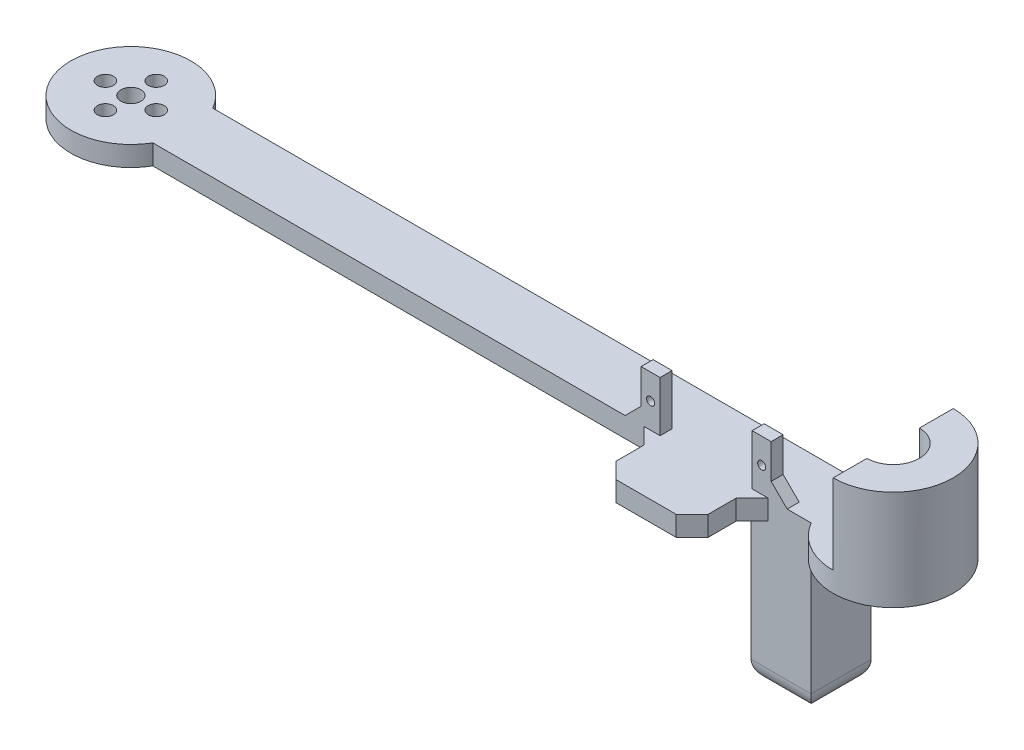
ISO-10303-21;
HEADER;
FILE_DESCRIPTION(('STEP AP214'),'2;1');
FILE_NAME('part.step','',(''),(''),'','','');
FILE_SCHEMA(('AUTOMOTIVE_DESIGN { 1 0 10303 214 1 1 1 1 }'));
ENDSEC;
DATA;
#1=APPLICATION_CONTEXT('core data for automotive mechanical design processes');
#2=APPLICATION_PROTOCOL_DEFINITION('international standard','automotive_design',2000,#1);
#3=PRODUCT_CONTEXT('',#1,'mechanical');
#4=PRODUCT('Part','Part','',(#3));
#5=PRODUCT_RELATED_PRODUCT_CATEGORY('part','',(#4));
#6=PRODUCT_DEFINITION_FORMATION('','',#4);
#7=PRODUCT_DEFINITION_CONTEXT('part definition',#1,'design');
#8=PRODUCT_DEFINITION('design','',#6,#7);
#9=PRODUCT_DEFINITION_SHAPE('','',#8);
#10=(LENGTH_UNIT() NAMED_UNIT(*) SI_UNIT(.MILLI.,.METRE.));
#11=(NAMED_UNIT(*) PLANE_ANGLE_UNIT() SI_UNIT($,.RADIAN.));
#12=(NAMED_UNIT(*) SI_UNIT($,.STERADIAN.) SOLID_ANGLE_UNIT());
#13=UNCERTAINTY_MEASURE_WITH_UNIT(LENGTH_MEASURE(1.E-05),#10,'distance_accuracy_value','');
#14=(GEOMETRIC_REPRESENTATION_CONTEXT(3) GLOBAL_UNCERTAINTY_ASSIGNED_CONTEXT((#13)) GLOBAL_UNIT_ASSIGNED_CONTEXT((#10,
#11,#12)) REPRESENTATION_CONTEXT('',''));
#15=CARTESIAN_POINT('',(0.,0.,0.));
#16=DIRECTION('',(0.,0.,1.));
#17=DIRECTION('',(1.,0.,0.));
#18=AXIS2_PLACEMENT_3D('',#15,#16,#17);
#19=CARTESIAN_POINT('',(0.,0.,0.));
#20=DIRECTION('',(0.,1.,0.));
#21=DIRECTION('',(0.,0.,1.));
#22=AXIS2_PLACEMENT_3D('',#19,#20,#21);
#23=PLANE('',#22);
#24=CARTESIAN_POINT('',(190.5,0.,-7.5));
#25=DIRECTION('',(0.,1.,0.));
#26=DIRECTION('',(0.,0.,1.));
#27=AXIS2_PLACEMENT_3D('',#24,#25,#26);
#28=CIRCLE('',#27,6.55000000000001);
#29=CARTESIAN_POINT('',(190.5,0.,-0.949999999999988));
#30=VERTEX_POINT('',#29);
#31=EDGE_CURVE('E400',#30,#30,#28,.T.);
#32=ORIENTED_EDGE('',*,*,#31,.T.);
#33=EDGE_LOOP('',(#32));
#34=FACE_BOUND('',#33,.T.);
#35=DIRECTION('',(0.,0.,1.));
#36=VECTOR('',#35,1.);
#37=CARTESIAN_POINT('',(177.509618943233,0.,0.));
#38=LINE('',#37,#36);
#39=CARTESIAN_POINT('',(177.509618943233,0.,-15.));
#40=VERTEX_POINT('',#39);
#41=CARTESIAN_POINT('',(177.509618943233,0.,0.));
#42=VERTEX_POINT('',#41);
#43=EDGE_CURVE('E271',#40,#42,#38,.T.);
#44=ORIENTED_EDGE('',*,*,#43,.F.);
#45=CARTESIAN_POINT('',(190.5,0.,-7.5));
#46=DIRECTION('',(0.,1.,0.));
#47=DIRECTION('',(0.,0.,1.));
#48=AXIS2_PLACEMENT_3D('',#45,#46,#47);
#49=CIRCLE('',#48,15.);
#50=EDGE_CURVE('E415',#42,#40,#49,.T.);
#51=ORIENTED_EDGE('',*,*,#50,.F.);
#52=EDGE_LOOP('',(#44,#51));
#53=FACE_BOUND('',#52,.T.);
#54=ADVANCED_FACE('F44',(#34,#53),#23,.F.);
#55=CARTESIAN_POINT('',(0.,0.,-13.85));
#56=DIRECTION('',(0.,1.,0.));
#57=DIRECTION('',(0.,0.,1.));
#58=AXIS2_PLACEMENT_3D('',#55,#56,#57);
#59=CIRCLE('',#58,2.);
#60=CARTESIAN_POINT('',(0.,0.,-11.85));
#61=VERTEX_POINT('',#60);
#62=EDGE_CURVE('E456',#61,#61,#59,.T.);
#63=ORIENTED_EDGE('',*,*,#62,.T.);
#64=EDGE_LOOP('',(#63));
#65=FACE_BOUND('',#64,.T.);
#66=CARTESIAN_POINT('',(6.35,0.,-7.49999999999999));
#67=DIRECTION('',(0.,1.,0.));
#68=DIRECTION('',(0.,0.,1.));
#69=AXIS2_PLACEMENT_3D('',#66,#67,#68);
#70=CIRCLE('',#69,2.);
#71=CARTESIAN_POINT('',(6.35,0.,-5.49999999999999));
#72=VERTEX_POINT('',#71);
#73=EDGE_CURVE('E1099',#72,#72,#70,.T.);
#74=ORIENTED_EDGE('',*,*,#73,.T.);
#75=EDGE_LOOP('',(#74));
#76=FACE_BOUND('',#75,.T.);
#77=CARTESIAN_POINT('',(0.,0.,-1.14999999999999));
#78=DIRECTION('',(0.,1.,0.));
#79=DIRECTION('',(0.,0.,1.));
#80=AXIS2_PLACEMENT_3D('',#77,#78,#79);
#81=CIRCLE('',#80,2.);
#82=CARTESIAN_POINT('',(0.,0.,0.850000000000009));
#83=VERTEX_POINT('',#82);
#84=EDGE_CURVE('E1096',#83,#83,#81,.T.);
#85=ORIENTED_EDGE('',*,*,#84,.T.);
#86=EDGE_LOOP('',(#85));
#87=FACE_BOUND('',#86,.T.);
#88=CARTESIAN_POINT('',(-6.35,0.,-7.49999999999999));
#89=DIRECTION('',(0.,1.,0.));
#90=DIRECTION('',(0.,0.,1.));
#91=AXIS2_PLACEMENT_3D('',#88,#89,#90);
#92=CIRCLE('',#91,2.);
#93=CARTESIAN_POINT('',(-6.35,0.,-5.49999999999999));
#94=VERTEX_POINT('',#93);
#95=EDGE_CURVE('E1093',#94,#94,#92,.T.);
#96=ORIENTED_EDGE('',*,*,#95,.T.);
#97=EDGE_LOOP('',(#96));
#98=FACE_BOUND('',#97,.T.);
#99=CARTESIAN_POINT('',(0.,0.,-7.49999999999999));
#100=DIRECTION('',(0.,1.,0.));
#101=DIRECTION('',(0.,0.,1.));
#102=AXIS2_PLACEMENT_3D('',#99,#100,#101);
#103=CIRCLE('',#102,2.5);
#104=CARTESIAN_POINT('',(0.,0.,-4.99999999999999));
#105=VERTEX_POINT('',#104);
#106=EDGE_CURVE('E393',#105,#105,#103,.T.);
#107=ORIENTED_EDGE('',*,*,#106,.T.);
#108=EDGE_LOOP('',(#107));
#109=FACE_BOUND('',#108,.T.);
#110=DIRECTION('',(1.,0.,0.));
#111=VECTOR('',#110,1.);
#112=CARTESIAN_POINT('',(139.759618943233,0.,15.));
#113=LINE('',#112,#111);
#114=CARTESIAN_POINT('',(143.759618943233,0.,15.));
#115=VERTEX_POINT('',#114);
#116=CARTESIAN_POINT('',(158.759618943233,0.,15.));
#117=VERTEX_POINT('',#116);
#118=EDGE_CURVE('E316',#115,#117,#113,.T.);
#119=ORIENTED_EDGE('',*,*,#118,.F.);
#120=DIRECTION('',(-0.707106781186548,0.,-0.707106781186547));
#121=VECTOR('',#120,1.);
#122=CARTESIAN_POINT('',(143.759618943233,0.,15.));
#123=LINE('',#122,#121);
#124=CARTESIAN_POINT('',(139.759618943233,0.,11.));
#125=VERTEX_POINT('',#124);
#126=EDGE_CURVE('E471',#115,#125,#123,.T.);
#127=ORIENTED_EDGE('',*,*,#126,.T.);
#128=DIRECTION('',(0.,0.,-1.));
#129=VECTOR('',#128,1.);
#130=CARTESIAN_POINT('',(139.759618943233,0.,15.));
#131=LINE('',#130,#129);
#132=CARTESIAN_POINT('',(139.759618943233,0.,4.));
#133=VERTEX_POINT('',#132);
#134=EDGE_CURVE('E331',#125,#133,#131,.T.);
#135=ORIENTED_EDGE('',*,*,#134,.T.);
#136=DIRECTION('',(0.707106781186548,0.,0.707106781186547));
#137=VECTOR('',#136,1.);
#138=CARTESIAN_POINT('',(67.8798094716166,0.,-67.8798094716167));
#139=LINE('',#138,#137);
#140=CARTESIAN_POINT('',(135.759618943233,0.,0.));
#141=VERTEX_POINT('',#140);
#142=EDGE_CURVE('E508',#133,#141,#139,.F.);
#143=ORIENTED_EDGE('',*,*,#142,.T.);
#144=DIRECTION('',(1.,0.,0.));
#145=VECTOR('',#144,1.);
#146=CARTESIAN_POINT('',(0.,0.,0.));
#147=LINE('',#146,#145);
#148=CARTESIAN_POINT('',(12.9903810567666,0.,0.));
#149=VERTEX_POINT('',#148);
#150=EDGE_CURVE('E429',#149,#141,#147,.T.);
#151=ORIENTED_EDGE('',*,*,#150,.F.);
#152=CARTESIAN_POINT('',(0.,0.,-7.49999999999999));
#153=DIRECTION('',(0.,1.,0.));
#154=DIRECTION('',(0.,0.,1.));
#155=AXIS2_PLACEMENT_3D('',#152,#153,#154);
#156=CIRCLE('',#155,15.);
#157=CARTESIAN_POINT('',(12.9903810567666,0.,-15.));
#158=VERTEX_POINT('',#157);
#159=EDGE_CURVE('E405',#158,#149,#156,.T.);
#160=ORIENTED_EDGE('',*,*,#159,.F.);
#161=DIRECTION('',(-1.,0.,0.));
#162=VECTOR('',#161,1.);
#163=CARTESIAN_POINT('',(190.5,0.,-15.));
#164=LINE('',#163,#162);
#165=CARTESIAN_POINT('',(162.509618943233,0.,-15.));
#166=VERTEX_POINT('',#165);
#167=EDGE_CURVE('E269',#166,#158,#164,.T.);
#168=ORIENTED_EDGE('',*,*,#167,.F.);
#169=DIRECTION('',(0.,0.,-1.));
#170=VECTOR('',#169,1.);
#171=CARTESIAN_POINT('',(162.509618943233,0.,0.));
#172=LINE('',#171,#170);
#173=CARTESIAN_POINT('',(162.509618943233,0.,0.));
#174=VERTEX_POINT('',#173);
#175=EDGE_CURVE('E253',#174,#166,#172,.T.);
#176=ORIENTED_EDGE('',*,*,#175,.F.);
#177=DIRECTION('',(-1.,0.,0.));
#178=VECTOR('',#177,1.);
#179=CARTESIAN_POINT('',(177.509618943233,0.,0.));
#180=LINE('',#179,#178);
#181=CARTESIAN_POINT('',(166.759618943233,0.,0.));
#182=VERTEX_POINT('',#181);
#183=EDGE_CURVE('E266',#182,#174,#180,.T.);
#184=ORIENTED_EDGE('',*,*,#183,.F.);
#185=DIRECTION('',(0.707106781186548,0.,-0.707106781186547));
#186=VECTOR('',#185,1.);
#187=CARTESIAN_POINT('',(83.3798094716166,0.,83.3798094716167));
#188=LINE('',#187,#186);
#189=CARTESIAN_POINT('',(162.759618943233,0.,4.));
#190=VERTEX_POINT('',#189);
#191=EDGE_CURVE('E506',#182,#190,#188,.F.);
#192=ORIENTED_EDGE('',*,*,#191,.T.);
#193=DIRECTION('',(0.,0.,-1.));
#194=VECTOR('',#193,1.);
#195=CARTESIAN_POINT('',(162.759618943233,0.,15.));
#196=LINE('',#195,#194);
#197=CARTESIAN_POINT('',(162.759618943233,0.,11.));
#198=VERTEX_POINT('',#197);
#199=EDGE_CURVE('E328',#198,#190,#196,.T.);
#200=ORIENTED_EDGE('',*,*,#199,.F.);
#201=DIRECTION('',(-0.707106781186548,0.,0.707106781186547));
#202=VECTOR('',#201,1.);
#203=CARTESIAN_POINT('',(158.759618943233,0.,15.));
#204=LINE('',#203,#202);
#205=EDGE_CURVE('E469',#198,#117,#204,.T.);
#206=ORIENTED_EDGE('',*,*,#205,.T.);
#207=EDGE_LOOP('',(#119,#127,#135,#143,#151,#160,#168,#176,#184,#192,#200,#206));
#208=FACE_BOUND('',#207,.T.);
#209=ADVANCED_FACE('F265',(#65,#76,#87,#98,#109,#208),#23,.F.);
#210=CARTESIAN_POINT('',(0.,5.,0.));
#211=DIRECTION('',(0.,0.,-1.));
#212=DIRECTION('',(-1.,0.,0.));
#213=AXIS2_PLACEMENT_3D('',#210,#211,#212);
#214=PLANE('',#213);
#215=CARTESIAN_POINT('',(137.384618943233,11.3,0.));
#216=DIRECTION('',(0.,0.,1.));
#217=DIRECTION('',(1.,0.,0.));
#218=AXIS2_PLACEMENT_3D('',#215,#216,#217);
#219=CIRCLE('',#218,0.999999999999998);
#220=CARTESIAN_POINT('',(138.384618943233,11.3,0.));
#221=VERTEX_POINT('',#220);
#222=EDGE_CURVE('E335',#221,#221,#219,.T.);
#223=ORIENTED_EDGE('',*,*,#222,.F.);
#224=EDGE_LOOP('',(#223));
#225=FACE_BOUND('',#224,.T.);
#226=ORIENTED_EDGE('',*,*,#150,.T.);
#227=DIRECTION('',(0.,1.,0.));
#228=VECTOR('',#227,1.);
#229=CARTESIAN_POINT('',(135.759618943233,5.,0.));
#230=LINE('',#229,#228);
#231=CARTESIAN_POINT('',(135.759618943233,5.,0.));
#232=VERTEX_POINT('',#231);
#233=EDGE_CURVE('E497',#141,#232,#230,.T.);
#234=ORIENTED_EDGE('',*,*,#233,.T.);
#235=DIRECTION('',(1.,0.,0.));
#236=VECTOR('',#235,1.);
#237=CARTESIAN_POINT('',(0.,5.,0.));
#238=LINE('',#237,#236);
#239=CARTESIAN_POINT('',(139.759618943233,5.,0.));
#240=VERTEX_POINT('',#239);
#241=EDGE_CURVE('E495',#232,#240,#238,.T.);
#242=ORIENTED_EDGE('',*,*,#241,.T.);
#243=DIRECTION('',(0.,-1.,0.));
#244=VECTOR('',#243,1.);
#245=CARTESIAN_POINT('',(139.759618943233,17.6,0.));
#246=LINE('',#245,#244);
#247=CARTESIAN_POINT('',(139.759618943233,17.6,0.));
#248=VERTEX_POINT('',#247);
#249=EDGE_CURVE('E377',#248,#240,#246,.T.);
#250=ORIENTED_EDGE('',*,*,#249,.F.);
#251=DIRECTION('',(1.,0.,0.));
#252=VECTOR('',#251,1.);
#253=CARTESIAN_POINT('',(0.,17.6,0.));
#254=LINE('',#253,#252);
#255=CARTESIAN_POINT('',(135.009618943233,17.6,0.));
#256=VERTEX_POINT('',#255);
#257=EDGE_CURVE('E375',#256,#248,#254,.T.);
#258=ORIENTED_EDGE('',*,*,#257,.F.);
#259=DIRECTION('',(0.,-1.,0.));
#260=VECTOR('',#259,1.);
#261=CARTESIAN_POINT('',(135.009618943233,17.6,0.));
#262=LINE('',#261,#260);
#263=CARTESIAN_POINT('',(135.009618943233,9.,0.));
#264=VERTEX_POINT('',#263);
#265=EDGE_CURVE('E383',#256,#264,#262,.T.);
#266=ORIENTED_EDGE('',*,*,#265,.T.);
#267=DIRECTION('',(-0.707106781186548,-0.707106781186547,0.));
#268=VECTOR('',#267,1.);
#269=CARTESIAN_POINT('',(65.5048094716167,-60.5048094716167,0.));
#270=LINE('',#269,#268);
#271=CARTESIAN_POINT('',(131.009618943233,5.,0.));
#272=VERTEX_POINT('',#271);
#273=EDGE_CURVE('E512',#264,#272,#270,.T.);
#274=ORIENTED_EDGE('',*,*,#273,.T.);
#275=DIRECTION('',(1.,0.,0.));
#276=VECTOR('',#275,1.);
#277=CARTESIAN_POINT('',(0.,5.,0.));
#278=LINE('',#277,#276);
#279=CARTESIAN_POINT('',(12.9903810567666,5.,0.));
#280=VERTEX_POINT('',#279);
#281=EDGE_CURVE('E278',#280,#272,#278,.T.);
#282=ORIENTED_EDGE('',*,*,#281,.F.);
#283=DIRECTION('',(0.,1.,0.));
#284=VECTOR('',#283,1.);
#285=CARTESIAN_POINT('',(12.9903810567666,0.,0.));
#286=LINE('',#285,#284);
#287=EDGE_CURVE('E407',#280,#149,#286,.F.);
#288=ORIENTED_EDGE('',*,*,#287,.T.);
#289=EDGE_LOOP('',(#226,#234,#242,#250,#258,#266,#274,#282,#288));
#290=FACE_BOUND('',#289,.T.);
#291=ADVANCED_FACE('F603',(#225,#290),#214,.F.);
#292=CARTESIAN_POINT('',(165.134618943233,11.3,0.));
#293=DIRECTION('',(0.,0.,1.));
#294=DIRECTION('',(1.,0.,0.));
#295=AXIS2_PLACEMENT_3D('',#292,#293,#294);
#296=CIRCLE('',#295,0.999999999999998);
#297=CARTESIAN_POINT('',(166.134618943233,11.3,0.));
#298=VERTEX_POINT('',#297);
#299=EDGE_CURVE('E334',#298,#298,#296,.T.);
#300=ORIENTED_EDGE('',*,*,#299,.F.);
#301=EDGE_LOOP('',(#300));
#302=FACE_BOUND('',#301,.T.);
#303=DIRECTION('',(0.,-1.,0.));
#304=VECTOR('',#303,1.);
#305=CARTESIAN_POINT('',(162.759618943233,17.6,0.));
#306=LINE('',#305,#304);
#307=CARTESIAN_POINT('',(162.759618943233,17.6,0.));
#308=VERTEX_POINT('',#307);
#309=CARTESIAN_POINT('',(162.759618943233,5.,0.));
#310=VERTEX_POINT('',#309);
#311=EDGE_CURVE('E359',#308,#310,#306,.T.);
#312=ORIENTED_EDGE('',*,*,#311,.T.);
#313=DIRECTION('',(1.,0.,0.));
#314=VECTOR('',#313,1.);
#315=CARTESIAN_POINT('',(0.,5.,0.));
#316=LINE('',#315,#314);
#317=CARTESIAN_POINT('',(166.759618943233,5.,0.));
#318=VERTEX_POINT('',#317);
#319=EDGE_CURVE('E60',#310,#318,#316,.T.);
#320=ORIENTED_EDGE('',*,*,#319,.T.);
#321=DIRECTION('',(0.,-1.,0.));
#322=VECTOR('',#321,1.);
#323=CARTESIAN_POINT('',(166.759618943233,0.,0.));
#324=LINE('',#323,#322);
#325=EDGE_CURVE('E275',#318,#182,#324,.T.);
#326=ORIENTED_EDGE('',*,*,#325,.T.);
#327=ORIENTED_EDGE('',*,*,#183,.T.);
#328=DIRECTION('',(0.,1.,0.));
#329=VECTOR('',#328,1.);
#330=CARTESIAN_POINT('',(162.509618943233,-37.,0.));
#331=LINE('',#330,#329);
#332=CARTESIAN_POINT('',(162.509618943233,-32.,0.));
#333=VERTEX_POINT('',#332);
#334=EDGE_CURVE('E249',#333,#174,#331,.T.);
#335=ORIENTED_EDGE('',*,*,#334,.F.);
#336=DIRECTION('',(-1.,0.,0.));
#337=VECTOR('',#336,1.);
#338=CARTESIAN_POINT('',(0.,-32.,0.));
#339=LINE('',#338,#337);
#340=CARTESIAN_POINT('',(177.509618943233,-32.,0.));
#341=VERTEX_POINT('',#340);
#342=EDGE_CURVE('E448',#333,#341,#339,.F.);
#343=ORIENTED_EDGE('',*,*,#342,.T.);
#344=DIRECTION('',(0.,1.,0.));
#345=VECTOR('',#344,1.);
#346=CARTESIAN_POINT('',(177.509618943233,-37.,0.));
#347=LINE('',#346,#345);
#348=EDGE_CURVE('E259',#341,#42,#347,.T.);
#349=ORIENTED_EDGE('',*,*,#348,.T.);
#350=DIRECTION('',(0.,1.,0.));
#351=VECTOR('',#350,1.);
#352=CARTESIAN_POINT('',(177.509618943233,0.,0.));
#353=LINE('',#352,#351);
#354=CARTESIAN_POINT('',(177.509618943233,5.,0.));
#355=VERTEX_POINT('',#354);
#356=EDGE_CURVE('E418',#42,#355,#353,.T.);
#357=ORIENTED_EDGE('',*,*,#356,.T.);
#358=CARTESIAN_POINT('',(171.509618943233,5.,0.));
#359=VERTEX_POINT('',#358);
#360=EDGE_CURVE('E283',#359,#355,#278,.T.);
#361=ORIENTED_EDGE('',*,*,#360,.F.);
#362=DIRECTION('',(0.707106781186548,-0.707106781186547,0.));
#363=VECTOR('',#362,1.);
#364=CARTESIAN_POINT('',(85.7548094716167,90.7548094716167,0.));
#365=LINE('',#364,#363);
#366=CARTESIAN_POINT('',(167.509618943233,9.,0.));
#367=VERTEX_POINT('',#366);
#368=EDGE_CURVE('E53',#359,#367,#365,.F.);
#369=ORIENTED_EDGE('',*,*,#368,.T.);
#370=DIRECTION('',(0.,-1.,0.));
#371=VECTOR('',#370,1.);
#372=CARTESIAN_POINT('',(167.509618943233,17.6,0.));
#373=LINE('',#372,#371);
#374=CARTESIAN_POINT('',(167.509618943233,17.6,0.));
#375=VERTEX_POINT('',#374);
#376=EDGE_CURVE('E352',#375,#367,#373,.T.);
#377=ORIENTED_EDGE('',*,*,#376,.F.);
#378=DIRECTION('',(1.,0.,0.));
#379=VECTOR('',#378,1.);
#380=CARTESIAN_POINT('',(0.,17.6,0.));
#381=LINE('',#380,#379);
#382=EDGE_CURVE('E350',#308,#375,#381,.T.);
#383=ORIENTED_EDGE('',*,*,#382,.F.);
#384=EDGE_LOOP('',(#312,#320,#326,#327,#335,#343,#349,#357,#361,#369,#377,#383));
#385=FACE_BOUND('',#384,.T.);
#386=ADVANCED_FACE('F273',(#302,#385),#214,.F.);
#387=CARTESIAN_POINT('',(190.5,5.,-15.));
#388=DIRECTION('',(0.,0.,1.));
#389=DIRECTION('',(1.,0.,0.));
#390=AXIS2_PLACEMENT_3D('',#387,#388,#389);
#391=PLANE('',#390);
#392=DIRECTION('',(0.,1.,0.));
#393=VECTOR('',#392,1.);
#394=CARTESIAN_POINT('',(177.509618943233,-37.,-15.));
#395=LINE('',#394,#393);
#396=CARTESIAN_POINT('',(177.509618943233,-32.,-15.));
#397=VERTEX_POINT('',#396);
#398=EDGE_CURVE('E270',#397,#40,#395,.T.);
#399=ORIENTED_EDGE('',*,*,#398,.F.);
#400=DIRECTION('',(1.,0.,0.));
#401=VECTOR('',#400,1.);
#402=CARTESIAN_POINT('',(190.5,-32.,-15.));
#403=LINE('',#402,#401);
#404=CARTESIAN_POINT('',(162.509618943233,-32.,-15.));
#405=VERTEX_POINT('',#404);
#406=EDGE_CURVE('E444',#397,#405,#403,.F.);
#407=ORIENTED_EDGE('',*,*,#406,.T.);
#408=DIRECTION('',(0.,1.,0.));
#409=VECTOR('',#408,1.);
#410=CARTESIAN_POINT('',(162.509618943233,-37.,-15.));
#411=LINE('',#410,#409);
#412=EDGE_CURVE('E260',#405,#166,#411,.T.);
#413=ORIENTED_EDGE('',*,*,#412,.T.);
#414=ORIENTED_EDGE('',*,*,#167,.T.);
#415=DIRECTION('',(0.,1.,0.));
#416=VECTOR('',#415,1.);
#417=CARTESIAN_POINT('',(12.9903810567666,0.,-15.));
#418=LINE('',#417,#416);
#419=CARTESIAN_POINT('',(12.9903810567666,5.,-15.));
#420=VERTEX_POINT('',#419);
#421=EDGE_CURVE('E411',#158,#420,#418,.T.);
#422=ORIENTED_EDGE('',*,*,#421,.T.);
#423=DIRECTION('',(-1.,0.,0.));
#424=VECTOR('',#423,1.);
#425=CARTESIAN_POINT('',(190.5,5.,-15.));
#426=LINE('',#425,#424);
#427=CARTESIAN_POINT('',(177.509618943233,5.,-15.));
#428=VERTEX_POINT('',#427);
#429=EDGE_CURVE('E427',#428,#420,#426,.T.);
#430=ORIENTED_EDGE('',*,*,#429,.F.);
#431=DIRECTION('',(0.,1.,0.));
#432=VECTOR('',#431,1.);
#433=CARTESIAN_POINT('',(177.509618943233,0.,-15.));
#434=LINE('',#433,#432);
#435=EDGE_CURVE('E424',#428,#40,#434,.F.);
#436=ORIENTED_EDGE('',*,*,#435,.T.);
#437=EDGE_LOOP('',(#399,#407,#413,#414,#422,#430,#436));
#438=FACE_BOUND('',#437,.T.);
#439=ADVANCED_FACE('F566',(#438),#391,.F.);
#440=CARTESIAN_POINT('',(0.,5.,0.));
#441=DIRECTION('',(0.,1.,0.));
#442=DIRECTION('',(0.,0.,1.));
#443=AXIS2_PLACEMENT_3D('',#440,#441,#442);
#444=PLANE('',#443);
#445=CARTESIAN_POINT('',(0.,5.,-13.85));
#446=DIRECTION('',(0.,1.,0.));
#447=DIRECTION('',(0.,0.,1.));
#448=AXIS2_PLACEMENT_3D('',#445,#446,#447);
#449=CIRCLE('',#448,2.);
#450=CARTESIAN_POINT('',(0.,5.,-11.85));
#451=VERTEX_POINT('',#450);
#452=EDGE_CURVE('E1077',#451,#451,#449,.T.);
#453=ORIENTED_EDGE('',*,*,#452,.F.);
#454=EDGE_LOOP('',(#453));
#455=FACE_BOUND('',#454,.T.);
#456=CARTESIAN_POINT('',(6.35,5.,-7.49999999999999));
#457=DIRECTION('',(0.,1.,0.));
#458=DIRECTION('',(0.,0.,1.));
#459=AXIS2_PLACEMENT_3D('',#456,#457,#458);
#460=CIRCLE('',#459,2.);
#461=CARTESIAN_POINT('',(6.35,5.,-5.49999999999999));
#462=VERTEX_POINT('',#461);
#463=EDGE_CURVE('E1081',#462,#462,#460,.T.);
#464=ORIENTED_EDGE('',*,*,#463,.F.);
#465=EDGE_LOOP('',(#464));
#466=FACE_BOUND('',#465,.T.);
#467=CARTESIAN_POINT('',(0.,5.,-1.14999999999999));
#468=DIRECTION('',(0.,1.,0.));
#469=DIRECTION('',(0.,0.,1.));
#470=AXIS2_PLACEMENT_3D('',#467,#468,#469);
#471=CIRCLE('',#470,2.);
#472=CARTESIAN_POINT('',(0.,5.,0.850000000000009));
#473=VERTEX_POINT('',#472);
#474=EDGE_CURVE('E1085',#473,#473,#471,.T.);
#475=ORIENTED_EDGE('',*,*,#474,.F.);
#476=EDGE_LOOP('',(#475));
#477=FACE_BOUND('',#476,.T.);
#478=CARTESIAN_POINT('',(-6.35,5.,-7.49999999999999));
#479=DIRECTION('',(0.,1.,0.));
#480=DIRECTION('',(0.,0.,1.));
#481=AXIS2_PLACEMENT_3D('',#478,#479,#480);
#482=CIRCLE('',#481,2.);
#483=CARTESIAN_POINT('',(-6.35,5.,-5.49999999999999));
#484=VERTEX_POINT('',#483);
#485=EDGE_CURVE('E1088',#484,#484,#482,.T.);
#486=ORIENTED_EDGE('',*,*,#485,.F.);
#487=EDGE_LOOP('',(#486));
#488=FACE_BOUND('',#487,.T.);
#489=DIRECTION('',(0.,0.,-1.));
#490=VECTOR('',#489,1.);
#491=CARTESIAN_POINT('',(139.759618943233,5.,15.));
#492=LINE('',#491,#490);
#493=CARTESIAN_POINT('',(139.759618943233,5.,11.));
#494=VERTEX_POINT('',#493);
#495=CARTESIAN_POINT('',(139.759618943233,5.,4.));
#496=VERTEX_POINT('',#495);
#497=EDGE_CURVE('E322',#494,#496,#492,.T.);
#498=ORIENTED_EDGE('',*,*,#497,.F.);
#499=DIRECTION('',(0.707106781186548,0.,0.707106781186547));
#500=VECTOR('',#499,1.);
#501=CARTESIAN_POINT('',(64.3798094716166,5.,-64.3798094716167));
#502=LINE('',#501,#500);
#503=CARTESIAN_POINT('',(143.759618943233,5.,15.));
#504=VERTEX_POINT('',#503);
#505=EDGE_CURVE('E486',#494,#504,#502,.T.);
#506=ORIENTED_EDGE('',*,*,#505,.T.);
#507=DIRECTION('',(-1.,0.,0.));
#508=VECTOR('',#507,1.);
#509=CARTESIAN_POINT('',(139.759618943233,5.,15.));
#510=LINE('',#509,#508);
#511=CARTESIAN_POINT('',(158.759618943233,5.,15.));
#512=VERTEX_POINT('',#511);
#513=EDGE_CURVE('E319',#512,#504,#510,.T.);
#514=ORIENTED_EDGE('',*,*,#513,.F.);
#515=DIRECTION('',(0.707106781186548,0.,-0.707106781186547));
#516=VECTOR('',#515,1.);
#517=CARTESIAN_POINT('',(86.8798094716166,5.,86.8798094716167));
#518=LINE('',#517,#516);
#519=CARTESIAN_POINT('',(162.759618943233,5.,11.));
#520=VERTEX_POINT('',#519);
#521=EDGE_CURVE('E484',#512,#520,#518,.T.);
#522=ORIENTED_EDGE('',*,*,#521,.T.);
#523=DIRECTION('',(0.,0.,-1.));
#524=VECTOR('',#523,1.);
#525=CARTESIAN_POINT('',(162.759618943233,5.,15.));
#526=LINE('',#525,#524);
#527=CARTESIAN_POINT('',(162.759618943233,5.,4.));
#528=VERTEX_POINT('',#527);
#529=EDGE_CURVE('E325',#520,#528,#526,.T.);
#530=ORIENTED_EDGE('',*,*,#529,.T.);
#531=DIRECTION('',(-0.707106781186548,0.,0.707106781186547));
#532=VECTOR('',#531,1.);
#533=CARTESIAN_POINT('',(162.759618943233,5.,4.));
#534=LINE('',#533,#532);
#535=EDGE_CURVE('E504',#528,#318,#534,.F.);
#536=ORIENTED_EDGE('',*,*,#535,.T.);
#537=ORIENTED_EDGE('',*,*,#319,.F.);
#538=DIRECTION('',(0.,0.,-1.));
#539=VECTOR('',#538,1.);
#540=CARTESIAN_POINT('',(162.759618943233,5.,0.));
#541=LINE('',#540,#539);
#542=CARTESIAN_POINT('',(162.759618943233,5.,-3.));
#543=VERTEX_POINT('',#542);
#544=EDGE_CURVE('E345',#310,#543,#541,.T.);
#545=ORIENTED_EDGE('',*,*,#544,.T.);
#546=DIRECTION('',(-1.,0.,0.));
#547=VECTOR('',#546,1.);
#548=CARTESIAN_POINT('',(0.,5.,-3.00000000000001));
#549=LINE('',#548,#547);
#550=CARTESIAN_POINT('',(171.509618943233,5.,-3.));
#551=VERTEX_POINT('',#550);
#552=EDGE_CURVE('E353',#551,#543,#549,.T.);
#553=ORIENTED_EDGE('',*,*,#552,.F.);
#554=DIRECTION('',(0.,0.,1.));
#555=VECTOR('',#554,1.);
#556=CARTESIAN_POINT('',(171.509618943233,5.,0.));
#557=LINE('',#556,#555);
#558=EDGE_CURVE('E478',#551,#359,#557,.T.);
#559=ORIENTED_EDGE('',*,*,#558,.T.);
#560=ORIENTED_EDGE('',*,*,#360,.T.);
#561=CARTESIAN_POINT('',(190.5,5.,-7.5));
#562=DIRECTION('',(0.,1.,0.));
#563=DIRECTION('',(0.,0.,1.));
#564=AXIS2_PLACEMENT_3D('',#561,#562,#563);
#565=CIRCLE('',#564,15.);
#566=CARTESIAN_POINT('',(190.5,5.,7.50000000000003));
#567=VERTEX_POINT('',#566);
#568=EDGE_CURVE('E419',#355,#567,#565,.T.);
#569=ORIENTED_EDGE('',*,*,#568,.T.);
#570=DIRECTION('',(0.,0.,-1.));
#571=VECTOR('',#570,1.);
#572=CARTESIAN_POINT('',(190.5,5.,0.));
#573=LINE('',#572,#571);
#574=CARTESIAN_POINT('',(190.5,5.,-0.949999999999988));
#575=VERTEX_POINT('',#574);
#576=EDGE_CURVE('E291',#567,#575,#573,.T.);
#577=ORIENTED_EDGE('',*,*,#576,.T.);
#578=CARTESIAN_POINT('',(190.5,5.,-7.5));
#579=DIRECTION('',(0.,1.,0.));
#580=DIRECTION('',(0.,0.,1.));
#581=AXIS2_PLACEMENT_3D('',#578,#579,#580);
#582=CIRCLE('',#581,6.55000000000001);
#583=CARTESIAN_POINT('',(190.5,5.,-14.05));
#584=VERTEX_POINT('',#583);
#585=EDGE_CURVE('E392',#584,#575,#582,.T.);
#586=ORIENTED_EDGE('',*,*,#585,.F.);
#587=DIRECTION('',(0.,0.,-1.));
#588=VECTOR('',#587,1.);
#589=CARTESIAN_POINT('',(190.5,5.,0.));
#590=LINE('',#589,#588);
#591=CARTESIAN_POINT('',(190.5,5.,-22.5));
#592=VERTEX_POINT('',#591);
#593=EDGE_CURVE('E296',#584,#592,#590,.T.);
#594=ORIENTED_EDGE('',*,*,#593,.T.);
#595=EDGE_CURVE('E414',#592,#428,#565,.T.);
#596=ORIENTED_EDGE('',*,*,#595,.T.);
#597=ORIENTED_EDGE('',*,*,#429,.T.);
#598=CARTESIAN_POINT('',(0.,5.,-7.49999999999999));
#599=DIRECTION('',(0.,1.,0.));
#600=DIRECTION('',(0.,0.,1.));
#601=AXIS2_PLACEMENT_3D('',#598,#599,#600);
#602=CIRCLE('',#601,15.);
#603=EDGE_CURVE('E396',#420,#280,#602,.T.);
#604=ORIENTED_EDGE('',*,*,#603,.T.);
#605=ORIENTED_EDGE('',*,*,#281,.T.);
#606=DIRECTION('',(0.,0.,-1.));
#607=VECTOR('',#606,1.);
#608=CARTESIAN_POINT('',(131.009618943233,5.,0.));
#609=LINE('',#608,#607);
#610=CARTESIAN_POINT('',(131.009618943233,5.,-3.));
#611=VERTEX_POINT('',#610);
#612=EDGE_CURVE('E481',#272,#611,#609,.T.);
#613=ORIENTED_EDGE('',*,*,#612,.T.);
#614=DIRECTION('',(-1.,0.,0.));
#615=VECTOR('',#614,1.);
#616=CARTESIAN_POINT('',(0.,5.,-3.));
#617=LINE('',#616,#615);
#618=CARTESIAN_POINT('',(139.759618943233,5.,-3.));
#619=VERTEX_POINT('',#618);
#620=EDGE_CURVE('E371',#619,#611,#617,.T.);
#621=ORIENTED_EDGE('',*,*,#620,.F.);
#622=DIRECTION('',(0.,0.,-1.));
#623=VECTOR('',#622,1.);
#624=CARTESIAN_POINT('',(139.759618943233,5.,0.));
#625=LINE('',#624,#623);
#626=EDGE_CURVE('E366',#240,#619,#625,.T.);
#627=ORIENTED_EDGE('',*,*,#626,.F.);
#628=ORIENTED_EDGE('',*,*,#241,.F.);
#629=DIRECTION('',(-0.707106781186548,0.,-0.707106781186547));
#630=VECTOR('',#629,1.);
#631=CARTESIAN_POINT('',(139.759618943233,5.,4.));
#632=LINE('',#631,#630);
#633=EDGE_CURVE('E510',#232,#496,#632,.F.);
#634=ORIENTED_EDGE('',*,*,#633,.T.);
#635=EDGE_LOOP('',(#498,#506,#514,#522,#530,#536,#537,#545,#553,#559,#560,#569,#577,#586,#594,
#596,#597,#604,#605,#613,#621,#627,#628,#634));
#636=FACE_BOUND('',#635,.T.);
#637=CARTESIAN_POINT('',(0.,5.,-7.49999999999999));
#638=DIRECTION('',(0.,1.,0.));
#639=DIRECTION('',(0.,0.,1.));
#640=AXIS2_PLACEMENT_3D('',#637,#638,#639);
#641=CIRCLE('',#640,2.5);
#642=CARTESIAN_POINT('',(0.,5.,-4.99999999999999));
#643=VERTEX_POINT('',#642);
#644=EDGE_CURVE('E397',#643,#643,#641,.T.);
#645=ORIENTED_EDGE('',*,*,#644,.F.);
#646=EDGE_LOOP('',(#645));
#647=FACE_BOUND('',#646,.T.);
#648=ADVANCED_FACE('F534',(#455,#466,#477,#488,#636,#647),#444,.T.);
#649=CARTESIAN_POINT('',(190.5,0.,-7.5));
#650=DIRECTION('',(0.,1.,0.));
#651=DIRECTION('',(0.,0.,1.));
#652=AXIS2_PLACEMENT_3D('',#649,#650,#651);
#653=CYLINDRICAL_SURFACE('',#652,15.);
#654=ORIENTED_EDGE('',*,*,#435,.F.);
#655=ORIENTED_EDGE('',*,*,#595,.F.);
#656=DIRECTION('',(0.,-1.,0.));
#657=VECTOR('',#656,1.);
#658=CARTESIAN_POINT('',(190.5,25.,-22.5));
#659=LINE('',#658,#657);
#660=CARTESIAN_POINT('',(190.5,25.,-22.5));
#661=VERTEX_POINT('',#660);
#662=EDGE_CURVE('E312',#661,#592,#659,.T.);
#663=ORIENTED_EDGE('',*,*,#662,.F.);
#664=CARTESIAN_POINT('',(190.5,25.,-7.5));
#665=DIRECTION('',(0.,1.,0.));
#666=DIRECTION('',(0.,0.,1.));
#667=AXIS2_PLACEMENT_3D('',#664,#665,#666);
#668=CIRCLE('',#667,15.);
#669=CARTESIAN_POINT('',(190.5,25.,7.50000000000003));
#670=VERTEX_POINT('',#669);
#671=EDGE_CURVE('E295',#670,#661,#668,.T.);
#672=ORIENTED_EDGE('',*,*,#671,.F.);
#673=DIRECTION('',(0.,-1.,0.));
#674=VECTOR('',#673,1.);
#675=CARTESIAN_POINT('',(190.5,25.,7.50000000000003));
#676=LINE('',#675,#674);
#677=EDGE_CURVE('E314',#670,#567,#676,.T.);
#678=ORIENTED_EDGE('',*,*,#677,.T.);
#679=ORIENTED_EDGE('',*,*,#568,.F.);
#680=ORIENTED_EDGE('',*,*,#356,.F.);
#681=ORIENTED_EDGE('',*,*,#50,.T.);
#682=EDGE_LOOP('',(#654,#655,#663,#672,#678,#679,#680,#681));
#683=FACE_BOUND('',#682,.T.);
#684=ADVANCED_FACE('F540',(#683),#653,.T.);
#685=CARTESIAN_POINT('',(0.,0.,-7.49999999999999));
#686=DIRECTION('',(0.,1.,0.));
#687=DIRECTION('',(0.,0.,1.));
#688=AXIS2_PLACEMENT_3D('',#685,#686,#687);
#689=CYLINDRICAL_SURFACE('',#688,15.);
#690=ORIENTED_EDGE('',*,*,#421,.F.);
#691=ORIENTED_EDGE('',*,*,#159,.T.);
#692=ORIENTED_EDGE('',*,*,#287,.F.);
#693=ORIENTED_EDGE('',*,*,#603,.F.);
#694=EDGE_LOOP('',(#690,#691,#692,#693));
#695=FACE_BOUND('',#694,.T.);
#696=ADVANCED_FACE('F702',(#695),#689,.T.);
#697=CARTESIAN_POINT('',(190.5,0.,-7.5));
#698=DIRECTION('',(0.,1.,0.));
#699=DIRECTION('',(0.,0.,1.));
#700=AXIS2_PLACEMENT_3D('',#697,#698,#699);
#701=CYLINDRICAL_SURFACE('',#700,6.55000000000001);
#702=ORIENTED_EDGE('',*,*,#31,.F.);
#703=EDGE_LOOP('',(#702));
#704=FACE_BOUND('',#703,.T.);
#705=ORIENTED_EDGE('',*,*,#585,.T.);
#706=DIRECTION('',(0.,-1.,0.));
#707=VECTOR('',#706,1.);
#708=CARTESIAN_POINT('',(190.5,25.,-0.949999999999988));
#709=LINE('',#708,#707);
#710=CARTESIAN_POINT('',(190.5,25.,-0.949999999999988));
#711=VERTEX_POINT('',#710);
#712=EDGE_CURVE('E303',#711,#575,#709,.T.);
#713=ORIENTED_EDGE('',*,*,#712,.F.);
#714=CARTESIAN_POINT('',(190.5,25.,-7.5));
#715=DIRECTION('',(0.,1.,0.));
#716=DIRECTION('',(0.,0.,1.));
#717=AXIS2_PLACEMENT_3D('',#714,#715,#716);
#718=CIRCLE('',#717,6.55000000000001);
#719=CARTESIAN_POINT('',(190.5,25.,-14.05));
#720=VERTEX_POINT('',#719);
#721=EDGE_CURVE('E301',#720,#711,#718,.F.);
#722=ORIENTED_EDGE('',*,*,#721,.F.);
#723=DIRECTION('',(0.,-1.,0.));
#724=VECTOR('',#723,1.);
#725=CARTESIAN_POINT('',(190.5,25.,-14.05));
#726=LINE('',#725,#724);
#727=EDGE_CURVE('E309',#720,#584,#726,.T.);
#728=ORIENTED_EDGE('',*,*,#727,.T.);
#729=EDGE_LOOP('',(#705,#713,#722,#728));
#730=FACE_BOUND('',#729,.T.);
#731=ADVANCED_FACE('F578',(#704,#730),#701,.F.);
#732=CARTESIAN_POINT('',(0.,0.,-7.49999999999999));
#733=DIRECTION('',(0.,1.,0.));
#734=DIRECTION('',(0.,0.,1.));
#735=AXIS2_PLACEMENT_3D('',#732,#733,#734);
#736=CYLINDRICAL_SURFACE('',#735,2.5);
#737=ORIENTED_EDGE('',*,*,#106,.F.);
#738=EDGE_LOOP('',(#737));
#739=FACE_BOUND('',#738,.T.);
#740=ORIENTED_EDGE('',*,*,#644,.T.);
#741=EDGE_LOOP('',(#740));
#742=FACE_BOUND('',#741,.T.);
#743=ADVANCED_FACE('F709',(#739,#742),#736,.F.);
#744=CARTESIAN_POINT('',(139.759618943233,17.6,0.));
#745=DIRECTION('',(-1.,0.,0.));
#746=DIRECTION('',(0.,0.,1.));
#747=AXIS2_PLACEMENT_3D('',#744,#745,#746);
#748=PLANE('',#747);
#749=ORIENTED_EDGE('',*,*,#626,.T.);
#750=DIRECTION('',(0.,-1.,0.));
#751=VECTOR('',#750,1.);
#752=CARTESIAN_POINT('',(139.759618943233,17.6,-3.));
#753=LINE('',#752,#751);
#754=CARTESIAN_POINT('',(139.759618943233,17.6,-3.));
#755=VERTEX_POINT('',#754);
#756=EDGE_CURVE('E389',#755,#619,#753,.T.);
#757=ORIENTED_EDGE('',*,*,#756,.F.);
#758=DIRECTION('',(0.,0.,-1.));
#759=VECTOR('',#758,1.);
#760=CARTESIAN_POINT('',(139.759618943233,17.6,0.));
#761=LINE('',#760,#759);
#762=EDGE_CURVE('E367',#248,#755,#761,.T.);
#763=ORIENTED_EDGE('',*,*,#762,.F.);
#764=ORIENTED_EDGE('',*,*,#249,.T.);
#765=EDGE_LOOP('',(#749,#757,#763,#764));
#766=FACE_BOUND('',#765,.T.);
#767=ADVANCED_FACE('F680',(#766),#748,.F.);
#768=CARTESIAN_POINT('',(0.,17.6,-3.));
#769=DIRECTION('',(0.,0.,1.));
#770=DIRECTION('',(1.,0.,0.));
#771=AXIS2_PLACEMENT_3D('',#768,#769,#770);
#772=PLANE('',#771);
#773=CARTESIAN_POINT('',(137.384618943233,11.3,-3.));
#774=DIRECTION('',(0.,0.,1.));
#775=DIRECTION('',(1.,0.,0.));
#776=AXIS2_PLACEMENT_3D('',#773,#774,#775);
#777=CIRCLE('',#776,0.999999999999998);
#778=CARTESIAN_POINT('',(138.384618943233,11.3,-3.));
#779=VERTEX_POINT('',#778);
#780=EDGE_CURVE('E356',#779,#779,#777,.T.);
#781=ORIENTED_EDGE('',*,*,#780,.T.);
#782=EDGE_LOOP('',(#781));
#783=FACE_BOUND('',#782,.T.);
#784=ORIENTED_EDGE('',*,*,#620,.T.);
#785=DIRECTION('',(0.707106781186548,0.707106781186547,0.));
#786=VECTOR('',#785,1.);
#787=CARTESIAN_POINT('',(71.8048094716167,-54.2048094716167,-3.));
#788=LINE('',#787,#786);
#789=CARTESIAN_POINT('',(135.009618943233,9.,-3.));
#790=VERTEX_POINT('',#789);
#791=EDGE_CURVE('E514',#611,#790,#788,.T.);
#792=ORIENTED_EDGE('',*,*,#791,.T.);
#793=DIRECTION('',(0.,-1.,0.));
#794=VECTOR('',#793,1.);
#795=CARTESIAN_POINT('',(135.009618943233,17.6,-3.));
#796=LINE('',#795,#794);
#797=CARTESIAN_POINT('',(135.009618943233,17.6,-3.));
#798=VERTEX_POINT('',#797);
#799=EDGE_CURVE('E386',#798,#790,#796,.T.);
#800=ORIENTED_EDGE('',*,*,#799,.F.);
#801=DIRECTION('',(-1.,0.,0.));
#802=VECTOR('',#801,1.);
#803=CARTESIAN_POINT('',(0.,17.6,-3.));
#804=LINE('',#803,#802);
#805=EDGE_CURVE('E370',#755,#798,#804,.T.);
#806=ORIENTED_EDGE('',*,*,#805,.F.);
#807=ORIENTED_EDGE('',*,*,#756,.T.);
#808=EDGE_LOOP('',(#784,#792,#800,#806,#807));
#809=FACE_BOUND('',#808,.T.);
#810=ADVANCED_FACE('F667',(#783,#809),#772,.F.);
#811=CARTESIAN_POINT('',(135.009618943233,17.6,0.));
#812=DIRECTION('',(1.,0.,0.));
#813=DIRECTION('',(0.,0.,-1.));
#814=AXIS2_PLACEMENT_3D('',#811,#812,#813);
#815=PLANE('',#814);
#816=ORIENTED_EDGE('',*,*,#799,.T.);
#817=DIRECTION('',(0.,0.,1.));
#818=VECTOR('',#817,1.);
#819=CARTESIAN_POINT('',(135.009618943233,9.,0.));
#820=LINE('',#819,#818);
#821=EDGE_CURVE('E500',#790,#264,#820,.T.);
#822=ORIENTED_EDGE('',*,*,#821,.T.);
#823=ORIENTED_EDGE('',*,*,#265,.F.);
#824=DIRECTION('',(0.,0.,1.));
#825=VECTOR('',#824,1.);
#826=CARTESIAN_POINT('',(135.009618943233,17.6,0.));
#827=LINE('',#826,#825);
#828=EDGE_CURVE('E373',#798,#256,#827,.T.);
#829=ORIENTED_EDGE('',*,*,#828,.F.);
#830=EDGE_LOOP('',(#816,#822,#823,#829));
#831=FACE_BOUND('',#830,.T.);
#832=ADVANCED_FACE('F670',(#831),#815,.F.);
#833=CARTESIAN_POINT('',(0.,17.6,0.));
#834=DIRECTION('',(0.,1.,0.));
#835=DIRECTION('',(0.,0.,1.));
#836=AXIS2_PLACEMENT_3D('',#833,#834,#835);
#837=PLANE('',#836);
#838=ORIENTED_EDGE('',*,*,#762,.T.);
#839=ORIENTED_EDGE('',*,*,#805,.T.);
#840=ORIENTED_EDGE('',*,*,#828,.T.);
#841=ORIENTED_EDGE('',*,*,#257,.T.);
#842=EDGE_LOOP('',(#838,#839,#840,#841));
#843=FACE_BOUND('',#842,.T.);
#844=ADVANCED_FACE('F674',(#843),#837,.T.);
#845=CARTESIAN_POINT('',(167.509618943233,17.6,0.));
#846=DIRECTION('',(1.,0.,0.));
#847=DIRECTION('',(0.,0.,-1.));
#848=AXIS2_PLACEMENT_3D('',#845,#846,#847);
#849=PLANE('',#848);
#850=ORIENTED_EDGE('',*,*,#376,.T.);
#851=DIRECTION('',(0.,0.,-1.));
#852=VECTOR('',#851,1.);
#853=CARTESIAN_POINT('',(167.509618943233,9.,-3.));
#854=LINE('',#853,#852);
#855=CARTESIAN_POINT('',(167.509618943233,9.,-3.));
#856=VERTEX_POINT('',#855);
#857=EDGE_CURVE('E68',#367,#856,#854,.T.);
#858=ORIENTED_EDGE('',*,*,#857,.T.);
#859=DIRECTION('',(0.,-1.,0.));
#860=VECTOR('',#859,1.);
#861=CARTESIAN_POINT('',(167.509618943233,17.6,-3.));
#862=LINE('',#861,#860);
#863=CARTESIAN_POINT('',(167.509618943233,17.6,-3.));
#864=VERTEX_POINT('',#863);
#865=EDGE_CURVE('E364',#864,#856,#862,.T.);
#866=ORIENTED_EDGE('',*,*,#865,.F.);
#867=DIRECTION('',(0.,0.,1.));
#868=VECTOR('',#867,1.);
#869=CARTESIAN_POINT('',(167.509618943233,17.6,0.));
#870=LINE('',#869,#868);
#871=EDGE_CURVE('E341',#864,#375,#870,.T.);
#872=ORIENTED_EDGE('',*,*,#871,.T.);
#873=EDGE_LOOP('',(#850,#858,#866,#872));
#874=FACE_BOUND('',#873,.T.);
#875=ADVANCED_FACE('F520',(#874),#849,.T.);
#876=CARTESIAN_POINT('',(0.,17.6,-3.00000000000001));
#877=DIRECTION('',(0.,0.,1.));
#878=DIRECTION('',(1.,0.,0.));
#879=AXIS2_PLACEMENT_3D('',#876,#877,#878);
#880=PLANE('',#879);
#881=CARTESIAN_POINT('',(165.134618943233,11.3,-3.));
#882=DIRECTION('',(0.,0.,1.));
#883=DIRECTION('',(1.,0.,0.));
#884=AXIS2_PLACEMENT_3D('',#881,#882,#883);
#885=CIRCLE('',#884,0.999999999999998);
#886=CARTESIAN_POINT('',(166.134618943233,11.3,-3.));
#887=VERTEX_POINT('',#886);
#888=EDGE_CURVE('E338',#887,#887,#885,.T.);
#889=ORIENTED_EDGE('',*,*,#888,.T.);
#890=EDGE_LOOP('',(#889));
#891=FACE_BOUND('',#890,.T.);
#892=ORIENTED_EDGE('',*,*,#552,.T.);
#893=DIRECTION('',(0.,-1.,0.));
#894=VECTOR('',#893,1.);
#895=CARTESIAN_POINT('',(162.759618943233,17.6,-3.));
#896=LINE('',#895,#894);
#897=CARTESIAN_POINT('',(162.759618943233,17.6,-3.));
#898=VERTEX_POINT('',#897);
#899=EDGE_CURVE('E361',#898,#543,#896,.T.);
#900=ORIENTED_EDGE('',*,*,#899,.F.);
#901=DIRECTION('',(-1.,0.,0.));
#902=VECTOR('',#901,1.);
#903=CARTESIAN_POINT('',(0.,17.6,-3.00000000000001));
#904=LINE('',#903,#902);
#905=EDGE_CURVE('E344',#864,#898,#904,.T.);
#906=ORIENTED_EDGE('',*,*,#905,.F.);
#907=ORIENTED_EDGE('',*,*,#865,.T.);
#908=DIRECTION('',(-0.707106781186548,0.707106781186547,0.));
#909=VECTOR('',#908,1.);
#910=CARTESIAN_POINT('',(79.4548094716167,97.0548094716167,-3.00000000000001));
#911=LINE('',#910,#909);
#912=EDGE_CURVE('E13',#856,#551,#911,.F.);
#913=ORIENTED_EDGE('',*,*,#912,.T.);
#914=EDGE_LOOP('',(#892,#900,#906,#907,#913));
#915=FACE_BOUND('',#914,.T.);
#916=ADVANCED_FACE('F524',(#891,#915),#880,.F.);
#917=CARTESIAN_POINT('',(162.759618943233,17.6,0.));
#918=DIRECTION('',(-1.,0.,0.));
#919=DIRECTION('',(0.,0.,1.));
#920=AXIS2_PLACEMENT_3D('',#917,#918,#919);
#921=PLANE('',#920);
#922=ORIENTED_EDGE('',*,*,#544,.F.);
#923=ORIENTED_EDGE('',*,*,#311,.F.);
#924=DIRECTION('',(0.,0.,-1.));
#925=VECTOR('',#924,1.);
#926=CARTESIAN_POINT('',(162.759618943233,17.6,0.));
#927=LINE('',#926,#925);
#928=EDGE_CURVE('E347',#308,#898,#927,.T.);
#929=ORIENTED_EDGE('',*,*,#928,.T.);
#930=ORIENTED_EDGE('',*,*,#899,.T.);
#931=EDGE_LOOP('',(#922,#923,#929,#930));
#932=FACE_BOUND('',#931,.T.);
#933=ADVANCED_FACE('F532',(#932),#921,.T.);
#934=CARTESIAN_POINT('',(0.,17.6,0.));
#935=DIRECTION('',(0.,1.,0.));
#936=DIRECTION('',(0.,0.,1.));
#937=AXIS2_PLACEMENT_3D('',#934,#935,#936);
#938=PLANE('',#937);
#939=ORIENTED_EDGE('',*,*,#871,.F.);
#940=ORIENTED_EDGE('',*,*,#905,.T.);
#941=ORIENTED_EDGE('',*,*,#928,.F.);
#942=ORIENTED_EDGE('',*,*,#382,.T.);
#943=EDGE_LOOP('',(#939,#940,#941,#942));
#944=FACE_BOUND('',#943,.T.);
#945=ADVANCED_FACE('F529',(#944),#938,.T.);
#946=CARTESIAN_POINT('',(165.134618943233,11.3,-12.6));
#947=DIRECTION('',(0.,0.,1.));
#948=DIRECTION('',(1.,0.,0.));
#949=AXIS2_PLACEMENT_3D('',#946,#947,#948);
#950=CYLINDRICAL_SURFACE('',#949,0.999999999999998);
#951=ORIENTED_EDGE('',*,*,#299,.T.);
#952=EDGE_LOOP('',(#951));
#953=FACE_BOUND('',#952,.T.);
#954=ORIENTED_EDGE('',*,*,#888,.F.);
#955=EDGE_LOOP('',(#954));
#956=FACE_BOUND('',#955,.T.);
#957=ADVANCED_FACE('F734',(#953,#956),#950,.F.);
#958=CARTESIAN_POINT('',(137.384618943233,11.3,-12.6));
#959=DIRECTION('',(0.,0.,1.));
#960=DIRECTION('',(1.,0.,0.));
#961=AXIS2_PLACEMENT_3D('',#958,#959,#960);
#962=CYLINDRICAL_SURFACE('',#961,0.999999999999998);
#963=ORIENTED_EDGE('',*,*,#222,.T.);
#964=EDGE_LOOP('',(#963));
#965=FACE_BOUND('',#964,.T.);
#966=ORIENTED_EDGE('',*,*,#780,.F.);
#967=EDGE_LOOP('',(#966));
#968=FACE_BOUND('',#967,.T.);
#969=ADVANCED_FACE('F737',(#965,#968),#962,.F.);
#970=CARTESIAN_POINT('',(139.759618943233,5.,15.));
#971=DIRECTION('',(1.,0.,0.));
#972=DIRECTION('',(0.,0.,-1.));
#973=AXIS2_PLACEMENT_3D('',#970,#971,#972);
#974=PLANE('',#973);
#975=ORIENTED_EDGE('',*,*,#134,.F.);
#976=DIRECTION('',(0.,1.,0.));
#977=VECTOR('',#976,1.);
#978=CARTESIAN_POINT('',(139.759618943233,5.,11.));
#979=LINE('',#978,#977);
#980=EDGE_CURVE('E476',#125,#494,#979,.T.);
#981=ORIENTED_EDGE('',*,*,#980,.T.);
#982=ORIENTED_EDGE('',*,*,#497,.T.);
#983=DIRECTION('',(0.,-1.,0.));
#984=VECTOR('',#983,1.);
#985=CARTESIAN_POINT('',(139.759618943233,0.,4.));
#986=LINE('',#985,#984);
#987=EDGE_CURVE('E473',#496,#133,#986,.T.);
#988=ORIENTED_EDGE('',*,*,#987,.T.);
#989=EDGE_LOOP('',(#975,#981,#982,#988));
#990=FACE_BOUND('',#989,.T.);
#991=ADVANCED_FACE('F690',(#990),#974,.F.);
#992=CARTESIAN_POINT('',(162.759618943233,5.,15.));
#993=DIRECTION('',(-1.,0.,0.));
#994=DIRECTION('',(0.,0.,1.));
#995=AXIS2_PLACEMENT_3D('',#992,#993,#994);
#996=PLANE('',#995);
#997=ORIENTED_EDGE('',*,*,#529,.F.);
#998=DIRECTION('',(0.,-1.,0.));
#999=VECTOR('',#998,1.);
#1000=CARTESIAN_POINT('',(162.759618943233,0.,11.));
#1001=LINE('',#1000,#999);
#1002=EDGE_CURVE('E491',#520,#198,#1001,.T.);
#1003=ORIENTED_EDGE('',*,*,#1002,.T.);
#1004=ORIENTED_EDGE('',*,*,#199,.T.);
#1005=DIRECTION('',(0.,1.,0.));
#1006=VECTOR('',#1005,1.);
#1007=CARTESIAN_POINT('',(162.759618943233,5.,4.));
#1008=LINE('',#1007,#1006);
#1009=EDGE_CURVE('E488',#190,#528,#1008,.T.);
#1010=ORIENTED_EDGE('',*,*,#1009,.T.);
#1011=EDGE_LOOP('',(#997,#1003,#1004,#1010));
#1012=FACE_BOUND('',#1011,.T.);
#1013=ADVANCED_FACE('F594',(#1012),#996,.F.);
#1014=CARTESIAN_POINT('',(0.,0.,15.));
#1015=DIRECTION('',(0.,0.,1.));
#1016=DIRECTION('',(1.,0.,0.));
#1017=AXIS2_PLACEMENT_3D('',#1014,#1015,#1016);
#1018=PLANE('',#1017);
#1019=ORIENTED_EDGE('',*,*,#513,.T.);
#1020=DIRECTION('',(0.,-1.,0.));
#1021=VECTOR('',#1020,1.);
#1022=CARTESIAN_POINT('',(143.759618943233,0.,15.));
#1023=LINE('',#1022,#1021);
#1024=EDGE_CURVE('E466',#504,#115,#1023,.T.);
#1025=ORIENTED_EDGE('',*,*,#1024,.T.);
#1026=ORIENTED_EDGE('',*,*,#118,.T.);
#1027=DIRECTION('',(0.,1.,0.));
#1028=VECTOR('',#1027,1.);
#1029=CARTESIAN_POINT('',(158.759618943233,5.,15.));
#1030=LINE('',#1029,#1028);
#1031=EDGE_CURVE('E452',#117,#512,#1030,.T.);
#1032=ORIENTED_EDGE('',*,*,#1031,.T.);
#1033=EDGE_LOOP('',(#1019,#1025,#1026,#1032));
#1034=FACE_BOUND('',#1033,.T.);
#1035=ADVANCED_FACE('F587',(#1034),#1018,.T.);
#1036=CARTESIAN_POINT('',(190.5,25.,0.));
#1037=DIRECTION('',(-1.,0.,0.));
#1038=DIRECTION('',(0.,0.,1.));
#1039=AXIS2_PLACEMENT_3D('',#1036,#1037,#1038);
#1040=PLANE('',#1039);
#1041=ORIENTED_EDGE('',*,*,#576,.F.);
#1042=ORIENTED_EDGE('',*,*,#677,.F.);
#1043=DIRECTION('',(0.,0.,-1.));
#1044=VECTOR('',#1043,1.);
#1045=CARTESIAN_POINT('',(190.5,25.,0.));
#1046=LINE('',#1045,#1044);
#1047=EDGE_CURVE('E292',#670,#711,#1046,.T.);
#1048=ORIENTED_EDGE('',*,*,#1047,.T.);
#1049=ORIENTED_EDGE('',*,*,#712,.T.);
#1050=EDGE_LOOP('',(#1041,#1042,#1048,#1049));
#1051=FACE_BOUND('',#1050,.T.);
#1052=ADVANCED_FACE('F585',(#1051),#1040,.T.);
#1053=CARTESIAN_POINT('',(190.5,25.,0.));
#1054=DIRECTION('',(-1.,0.,0.));
#1055=DIRECTION('',(0.,0.,1.));
#1056=AXIS2_PLACEMENT_3D('',#1053,#1054,#1055);
#1057=PLANE('',#1056);
#1058=ORIENTED_EDGE('',*,*,#593,.F.);
#1059=ORIENTED_EDGE('',*,*,#727,.F.);
#1060=DIRECTION('',(0.,0.,-1.));
#1061=VECTOR('',#1060,1.);
#1062=CARTESIAN_POINT('',(190.5,25.,0.));
#1063=LINE('',#1062,#1061);
#1064=EDGE_CURVE('E298',#720,#661,#1063,.T.);
#1065=ORIENTED_EDGE('',*,*,#1064,.T.);
#1066=ORIENTED_EDGE('',*,*,#662,.T.);
#1067=EDGE_LOOP('',(#1058,#1059,#1065,#1066));
#1068=FACE_BOUND('',#1067,.T.);
#1069=ADVANCED_FACE('F575',(#1068),#1057,.T.);
#1070=CARTESIAN_POINT('',(0.,25.,0.));
#1071=DIRECTION('',(0.,1.,0.));
#1072=DIRECTION('',(0.,0.,1.));
#1073=AXIS2_PLACEMENT_3D('',#1070,#1071,#1072);
#1074=PLANE('',#1073);
#1075=ORIENTED_EDGE('',*,*,#1047,.F.);
#1076=ORIENTED_EDGE('',*,*,#671,.T.);
#1077=ORIENTED_EDGE('',*,*,#1064,.F.);
#1078=ORIENTED_EDGE('',*,*,#721,.T.);
#1079=EDGE_LOOP('',(#1075,#1076,#1077,#1078));
#1080=FACE_BOUND('',#1079,.T.);
#1081=ADVANCED_FACE('F583',(#1080),#1074,.T.);
#1082=CARTESIAN_POINT('',(177.509618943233,-37.,0.));
#1083=DIRECTION('',(-1.,0.,0.));
#1084=DIRECTION('',(0.,0.,1.));
#1085=AXIS2_PLACEMENT_3D('',#1082,#1083,#1084);
#1086=PLANE('',#1085);
#1087=ORIENTED_EDGE('',*,*,#348,.F.);
#1088=DIRECTION('',(0.,0.,1.));
#1089=VECTOR('',#1088,1.);
#1090=CARTESIAN_POINT('',(177.509618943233,-32.,0.));
#1091=LINE('',#1090,#1089);
#1092=EDGE_CURVE('E450',#341,#397,#1091,.F.);
#1093=ORIENTED_EDGE('',*,*,#1092,.T.);
#1094=ORIENTED_EDGE('',*,*,#398,.T.);
#1095=ORIENTED_EDGE('',*,*,#43,.T.);
#1096=EDGE_LOOP('',(#1087,#1093,#1094,#1095));
#1097=FACE_BOUND('',#1096,.T.);
#1098=ADVANCED_FACE('F548',(#1097),#1086,.F.);
#1099=CARTESIAN_POINT('',(162.509618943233,-37.,0.));
#1100=DIRECTION('',(1.,0.,0.));
#1101=DIRECTION('',(0.,0.,-1.));
#1102=AXIS2_PLACEMENT_3D('',#1099,#1100,#1101);
#1103=PLANE('',#1102);
#1104=ORIENTED_EDGE('',*,*,#412,.F.);
#1105=DIRECTION('',(0.,0.,-1.));
#1106=VECTOR('',#1105,1.);
#1107=CARTESIAN_POINT('',(162.509618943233,-32.,0.));
#1108=LINE('',#1107,#1106);
#1109=EDGE_CURVE('E255',#405,#333,#1108,.F.);
#1110=ORIENTED_EDGE('',*,*,#1109,.T.);
#1111=ORIENTED_EDGE('',*,*,#334,.T.);
#1112=ORIENTED_EDGE('',*,*,#175,.T.);
#1113=EDGE_LOOP('',(#1104,#1110,#1111,#1112));
#1114=FACE_BOUND('',#1113,.T.);
#1115=ADVANCED_FACE('F252',(#1114),#1103,.F.);
#1116=CARTESIAN_POINT('',(0.,-37.,0.));
#1117=DIRECTION('',(0.,1.,0.));
#1118=DIRECTION('',(0.,0.,1.));
#1119=AXIS2_PLACEMENT_3D('',#1116,#1117,#1118);
#1120=PLANE('',#1119);
#1121=DIRECTION('',(0.,0.,-1.));
#1122=VECTOR('',#1121,1.);
#1123=CARTESIAN_POINT('',(167.509618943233,-37.,0.));
#1124=LINE('',#1123,#1122);
#1125=CARTESIAN_POINT('',(167.509618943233,-37.,-5.));
#1126=VERTEX_POINT('',#1125);
#1127=CARTESIAN_POINT('',(167.509618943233,-37.,-9.99999999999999));
#1128=VERTEX_POINT('',#1127);
#1129=EDGE_CURVE('E439',#1126,#1128,#1124,.T.);
#1130=ORIENTED_EDGE('',*,*,#1129,.T.);
#1131=DIRECTION('',(1.,0.,0.));
#1132=VECTOR('',#1131,1.);
#1133=CARTESIAN_POINT('',(0.,-37.,-9.99999999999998));
#1134=LINE('',#1133,#1132);
#1135=CARTESIAN_POINT('',(172.509618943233,-37.,-10.));
#1136=VERTEX_POINT('',#1135);
#1137=EDGE_CURVE('E441',#1128,#1136,#1134,.T.);
#1138=ORIENTED_EDGE('',*,*,#1137,.T.);
#1139=DIRECTION('',(0.,0.,1.));
#1140=VECTOR('',#1139,1.);
#1141=CARTESIAN_POINT('',(172.509618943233,-37.,0.));
#1142=LINE('',#1141,#1140);
#1143=CARTESIAN_POINT('',(172.509618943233,-37.,-5.));
#1144=VERTEX_POINT('',#1143);
#1145=EDGE_CURVE('E277',#1136,#1144,#1142,.T.);
#1146=ORIENTED_EDGE('',*,*,#1145,.T.);
#1147=DIRECTION('',(-1.,0.,0.));
#1148=VECTOR('',#1147,1.);
#1149=CARTESIAN_POINT('',(0.,-37.,-5.));
#1150=LINE('',#1149,#1148);
#1151=EDGE_CURVE('E280',#1144,#1126,#1150,.T.);
#1152=ORIENTED_EDGE('',*,*,#1151,.T.);
#1153=EDGE_LOOP('',(#1130,#1138,#1146,#1152));
#1154=FACE_BOUND('',#1153,.T.);
#1155=ADVANCED_FACE('F624',(#1154),#1120,.F.);
#1156=CARTESIAN_POINT('',(0.,-32.,-5.));
#1157=DIRECTION('',(-1.,0.,0.));
#1158=DIRECTION('',(0.,0.,1.));
#1159=AXIS2_PLACEMENT_3D('',#1156,#1157,#1158);
#1160=CYLINDRICAL_SURFACE('',#1159,5.);
#1161=CARTESIAN_POINT('',(172.509618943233,-32.,-5.));
#1162=DIRECTION('',(-0.707106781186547,0.,0.707106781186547));
#1163=DIRECTION('',(0.707106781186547,0.,0.707106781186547));
#1164=AXIS2_PLACEMENT_3D('',#1161,#1162,#1163);
#1165=ELLIPSE('',#1164,7.07106781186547,5.);
#1166=EDGE_CURVE('E458',#341,#1144,#1165,.F.);
#1167=ORIENTED_EDGE('',*,*,#1166,.F.);
#1168=ORIENTED_EDGE('',*,*,#342,.F.);
#1169=CARTESIAN_POINT('',(167.509618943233,-32.,-5.));
#1170=DIRECTION('',(-0.707106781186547,0.,-0.707106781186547));
#1171=DIRECTION('',(-0.707106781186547,0.,0.707106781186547));
#1172=AXIS2_PLACEMENT_3D('',#1169,#1170,#1171);
#1173=ELLIPSE('',#1172,7.07106781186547,5.);
#1174=EDGE_CURVE('E461',#1126,#333,#1173,.T.);
#1175=ORIENTED_EDGE('',*,*,#1174,.F.);
#1176=ORIENTED_EDGE('',*,*,#1151,.F.);
#1177=EDGE_LOOP('',(#1167,#1168,#1175,#1176));
#1178=FACE_BOUND('',#1177,.T.);
#1179=ADVANCED_FACE('F554',(#1178),#1160,.T.);
#1180=CARTESIAN_POINT('',(167.509618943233,-32.,0.));
#1181=DIRECTION('',(0.,0.,-1.));
#1182=DIRECTION('',(-1.,0.,0.));
#1183=AXIS2_PLACEMENT_3D('',#1180,#1181,#1182);
#1184=CYLINDRICAL_SURFACE('',#1183,5.);
#1185=ORIENTED_EDGE('',*,*,#1174,.T.);
#1186=ORIENTED_EDGE('',*,*,#1109,.F.);
#1187=CARTESIAN_POINT('',(167.509618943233,-32.,-10.));
#1188=DIRECTION('',(0.707106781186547,0.,-0.707106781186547));
#1189=DIRECTION('',(-0.707106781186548,0.,-0.707106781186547));
#1190=AXIS2_PLACEMENT_3D('',#1187,#1188,#1189);
#1191=ELLIPSE('',#1190,7.07106781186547,5.);
#1192=EDGE_CURVE('E455',#1128,#405,#1191,.T.);
#1193=ORIENTED_EDGE('',*,*,#1192,.F.);
#1194=ORIENTED_EDGE('',*,*,#1129,.F.);
#1195=EDGE_LOOP('',(#1185,#1186,#1193,#1194));
#1196=FACE_BOUND('',#1195,.T.);
#1197=ADVANCED_FACE('F618',(#1196),#1184,.T.);
#1198=CARTESIAN_POINT('',(172.509618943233,-32.,0.));
#1199=DIRECTION('',(0.,0.,1.));
#1200=DIRECTION('',(1.,0.,0.));
#1201=AXIS2_PLACEMENT_3D('',#1198,#1199,#1200);
#1202=CYLINDRICAL_SURFACE('',#1201,5.);
#1203=ORIENTED_EDGE('',*,*,#1166,.T.);
#1204=ORIENTED_EDGE('',*,*,#1145,.F.);
#1205=CARTESIAN_POINT('',(172.509618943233,-32.,-10.));
#1206=DIRECTION('',(0.707106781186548,0.,0.707106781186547));
#1207=DIRECTION('',(-0.707106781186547,0.,0.707106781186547));
#1208=AXIS2_PLACEMENT_3D('',#1205,#1206,#1207);
#1209=ELLIPSE('',#1208,7.07106781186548,5.);
#1210=EDGE_CURVE('E453',#397,#1136,#1209,.F.);
#1211=ORIENTED_EDGE('',*,*,#1210,.F.);
#1212=ORIENTED_EDGE('',*,*,#1092,.F.);
#1213=EDGE_LOOP('',(#1203,#1204,#1211,#1212));
#1214=FACE_BOUND('',#1213,.T.);
#1215=ADVANCED_FACE('F559',(#1214),#1202,.T.);
#1216=CARTESIAN_POINT('',(0.,-32.,-9.99999999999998));
#1217=DIRECTION('',(1.,0.,0.));
#1218=DIRECTION('',(0.,0.,-1.));
#1219=AXIS2_PLACEMENT_3D('',#1216,#1217,#1218);
#1220=CYLINDRICAL_SURFACE('',#1219,5.);
#1221=ORIENTED_EDGE('',*,*,#1192,.T.);
#1222=ORIENTED_EDGE('',*,*,#406,.F.);
#1223=ORIENTED_EDGE('',*,*,#1210,.T.);
#1224=ORIENTED_EDGE('',*,*,#1137,.F.);
#1225=EDGE_LOOP('',(#1221,#1222,#1223,#1224));
#1226=FACE_BOUND('',#1225,.T.);
#1227=ADVANCED_FACE('F563',(#1226),#1220,.T.);
#1228=CARTESIAN_POINT('',(-6.35,-42.,-7.49999999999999));
#1229=DIRECTION('',(0.,1.,0.));
#1230=DIRECTION('',(0.,0.,1.));
#1231=AXIS2_PLACEMENT_3D('',#1228,#1229,#1230);
#1232=CYLINDRICAL_SURFACE('',#1231,2.);
#1233=ORIENTED_EDGE('',*,*,#485,.T.);
#1234=EDGE_LOOP('',(#1233));
#1235=FACE_BOUND('',#1234,.T.);
#1236=ORIENTED_EDGE('',*,*,#95,.F.);
#1237=EDGE_LOOP('',(#1236));
#1238=FACE_BOUND('',#1237,.T.);
#1239=ADVANCED_FACE('F615',(#1235,#1238),#1232,.F.);
#1240=CARTESIAN_POINT('',(0.,-42.,-1.14999999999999));
#1241=DIRECTION('',(0.,1.,0.));
#1242=DIRECTION('',(0.,0.,1.));
#1243=AXIS2_PLACEMENT_3D('',#1240,#1241,#1242);
#1244=CYLINDRICAL_SURFACE('',#1243,2.);
#1245=ORIENTED_EDGE('',*,*,#474,.T.);
#1246=EDGE_LOOP('',(#1245));
#1247=FACE_BOUND('',#1246,.T.);
#1248=ORIENTED_EDGE('',*,*,#84,.F.);
#1249=EDGE_LOOP('',(#1248));
#1250=FACE_BOUND('',#1249,.T.);
#1251=ADVANCED_FACE('F805',(#1247,#1250),#1244,.F.);
#1252=CARTESIAN_POINT('',(6.35,-42.,-7.49999999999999));
#1253=DIRECTION('',(0.,1.,0.));
#1254=DIRECTION('',(0.,0.,1.));
#1255=AXIS2_PLACEMENT_3D('',#1252,#1253,#1254);
#1256=CYLINDRICAL_SURFACE('',#1255,2.);
#1257=ORIENTED_EDGE('',*,*,#463,.T.);
#1258=EDGE_LOOP('',(#1257));
#1259=FACE_BOUND('',#1258,.T.);
#1260=ORIENTED_EDGE('',*,*,#73,.F.);
#1261=EDGE_LOOP('',(#1260));
#1262=FACE_BOUND('',#1261,.T.);
#1263=ADVANCED_FACE('F797',(#1259,#1262),#1256,.F.);
#1264=CARTESIAN_POINT('',(0.,-42.,-13.85));
#1265=DIRECTION('',(0.,1.,0.));
#1266=DIRECTION('',(0.,0.,1.));
#1267=AXIS2_PLACEMENT_3D('',#1264,#1265,#1266);
#1268=CYLINDRICAL_SURFACE('',#1267,2.);
#1269=ORIENTED_EDGE('',*,*,#452,.T.);
#1270=EDGE_LOOP('',(#1269));
#1271=FACE_BOUND('',#1270,.T.);
#1272=ORIENTED_EDGE('',*,*,#62,.F.);
#1273=EDGE_LOOP('',(#1272));
#1274=FACE_BOUND('',#1273,.T.);
#1275=ADVANCED_FACE('F633',(#1271,#1274),#1268,.F.);
#1276=CARTESIAN_POINT('',(143.759618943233,0.,15.));
#1277=DIRECTION('',(-0.707106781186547,0.,0.707106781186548));
#1278=DIRECTION('',(0.,1.,0.));
#1279=AXIS2_PLACEMENT_3D('',#1276,#1277,#1278);
#1280=PLANE('',#1279);
#1281=ORIENTED_EDGE('',*,*,#505,.F.);
#1282=ORIENTED_EDGE('',*,*,#980,.F.);
#1283=ORIENTED_EDGE('',*,*,#126,.F.);
#1284=ORIENTED_EDGE('',*,*,#1024,.F.);
#1285=EDGE_LOOP('',(#1281,#1282,#1283,#1284));
#1286=FACE_BOUND('',#1285,.T.);
#1287=ADVANCED_FACE('F626',(#1286),#1280,.T.);
#1288=CARTESIAN_POINT('',(158.759618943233,0.,15.));
#1289=DIRECTION('',(0.707106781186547,0.,0.707106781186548));
#1290=DIRECTION('',(0.,-1.,0.));
#1291=AXIS2_PLACEMENT_3D('',#1288,#1289,#1290);
#1292=PLANE('',#1291);
#1293=ORIENTED_EDGE('',*,*,#205,.F.);
#1294=ORIENTED_EDGE('',*,*,#1002,.F.);
#1295=ORIENTED_EDGE('',*,*,#521,.F.);
#1296=ORIENTED_EDGE('',*,*,#1031,.F.);
#1297=EDGE_LOOP('',(#1293,#1294,#1295,#1296));
#1298=FACE_BOUND('',#1297,.T.);
#1299=ADVANCED_FACE('F632',(#1298),#1292,.T.);
#1300=CARTESIAN_POINT('',(162.759618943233,5.,4.));
#1301=DIRECTION('',(0.707106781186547,0.,0.707106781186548));
#1302=DIRECTION('',(0.,-1.,0.));
#1303=AXIS2_PLACEMENT_3D('',#1300,#1301,#1302);
#1304=PLANE('',#1303);
#1305=ORIENTED_EDGE('',*,*,#191,.F.);
#1306=ORIENTED_EDGE('',*,*,#325,.F.);
#1307=ORIENTED_EDGE('',*,*,#535,.F.);
#1308=ORIENTED_EDGE('',*,*,#1009,.F.);
#1309=EDGE_LOOP('',(#1305,#1306,#1307,#1308));
#1310=FACE_BOUND('',#1309,.T.);
#1311=ADVANCED_FACE('F640',(#1310),#1304,.T.);
#1312=CARTESIAN_POINT('',(139.759618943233,5.,4.));
#1313=DIRECTION('',(-0.707106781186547,0.,0.707106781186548));
#1314=DIRECTION('',(0.,1.,0.));
#1315=AXIS2_PLACEMENT_3D('',#1312,#1313,#1314);
#1316=PLANE('',#1315);
#1317=ORIENTED_EDGE('',*,*,#633,.F.);
#1318=ORIENTED_EDGE('',*,*,#233,.F.);
#1319=ORIENTED_EDGE('',*,*,#142,.F.);
#1320=ORIENTED_EDGE('',*,*,#987,.F.);
#1321=EDGE_LOOP('',(#1317,#1318,#1319,#1320));
#1322=FACE_BOUND('',#1321,.T.);
#1323=ADVANCED_FACE('F647',(#1322),#1316,.T.);
#1324=CARTESIAN_POINT('',(135.009618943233,9.,0.));
#1325=DIRECTION('',(0.707106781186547,-0.707106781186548,0.));
#1326=DIRECTION('',(0.,0.,1.));
#1327=AXIS2_PLACEMENT_3D('',#1324,#1325,#1326);
#1328=PLANE('',#1327);
#1329=ORIENTED_EDGE('',*,*,#791,.F.);
#1330=ORIENTED_EDGE('',*,*,#612,.F.);
#1331=ORIENTED_EDGE('',*,*,#273,.F.);
#1332=ORIENTED_EDGE('',*,*,#821,.F.);
#1333=EDGE_LOOP('',(#1329,#1330,#1331,#1332));
#1334=FACE_BOUND('',#1333,.T.);
#1335=ADVANCED_FACE('F653',(#1334),#1328,.F.);
#1336=CARTESIAN_POINT('',(171.509618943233,5.,0.));
#1337=DIRECTION('',(0.707106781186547,0.707106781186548,0.));
#1338=DIRECTION('',(0.,0.,-1.));
#1339=AXIS2_PLACEMENT_3D('',#1336,#1337,#1338);
#1340=PLANE('',#1339);
#1341=ORIENTED_EDGE('',*,*,#912,.F.);
#1342=ORIENTED_EDGE('',*,*,#857,.F.);
#1343=ORIENTED_EDGE('',*,*,#368,.F.);
#1344=ORIENTED_EDGE('',*,*,#558,.F.);
#1345=EDGE_LOOP('',(#1341,#1342,#1343,#1344));
#1346=FACE_BOUND('',#1345,.T.);
#1347=ADVANCED_FACE('F47',(#1346),#1340,.T.);
#1348=CLOSED_SHELL('',(#54,#209,#291,#386,#439,#648,#684,#696,#731,#743,#767,#810,#832,#844,
#875,#916,#933,#945,#957,#969,#991,#1013,#1035,#1052,#1069,#1081,#1098,#1115,#1155,#1179,#1197,
#1215,#1227,#1239,#1251,#1263,#1275,#1287,#1299,#1311,#1323,#1335,#1347));
#1349=MANIFOLD_SOLID_BREP('B2',#1348);
#1350=ADVANCED_BREP_SHAPE_REPRESENTATION('',(#18,#1349),#14);
#1351=SHAPE_DEFINITION_REPRESENTATION(#9,#1350);
ENDSEC;
END-ISO-10303-21;
